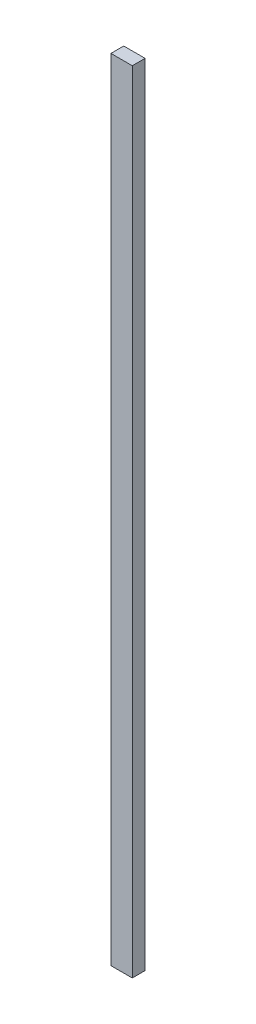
ISO-10303-21;
HEADER;
FILE_DESCRIPTION(('STEP AP214'),'2;1');
FILE_NAME('part.step','',(''),(''),'','','');
FILE_SCHEMA(('AUTOMOTIVE_DESIGN { 1 0 10303 214 1 1 1 1 }'));
ENDSEC;
DATA;
#1=APPLICATION_CONTEXT('core data for automotive mechanical design processes');
#2=APPLICATION_PROTOCOL_DEFINITION('international standard','automotive_design',2000,#1);
#3=PRODUCT_CONTEXT('',#1,'mechanical');
#4=PRODUCT('Part','Part','',(#3));
#5=PRODUCT_RELATED_PRODUCT_CATEGORY('part','',(#4));
#6=PRODUCT_DEFINITION_FORMATION('','',#4);
#7=PRODUCT_DEFINITION_CONTEXT('part definition',#1,'design');
#8=PRODUCT_DEFINITION('design','',#6,#7);
#9=PRODUCT_DEFINITION_SHAPE('','',#8);
#10=(LENGTH_UNIT() NAMED_UNIT(*) SI_UNIT(.MILLI.,.METRE.));
#11=(NAMED_UNIT(*) PLANE_ANGLE_UNIT() SI_UNIT($,.RADIAN.));
#12=(NAMED_UNIT(*) SI_UNIT($,.STERADIAN.) SOLID_ANGLE_UNIT());
#13=UNCERTAINTY_MEASURE_WITH_UNIT(LENGTH_MEASURE(1.E-05),#10,'distance_accuracy_value','');
#14=(GEOMETRIC_REPRESENTATION_CONTEXT(3) GLOBAL_UNCERTAINTY_ASSIGNED_CONTEXT((#13)) GLOBAL_UNIT_ASSIGNED_CONTEXT((#10,
#11,#12)) REPRESENTATION_CONTEXT('',''));
#15=CARTESIAN_POINT('',(0.,0.,0.));
#16=DIRECTION('',(0.,0.,1.));
#17=DIRECTION('',(1.,0.,0.));
#18=AXIS2_PLACEMENT_3D('',#15,#16,#17);
#19=CARTESIAN_POINT('',(0.,0.,12.));
#20=DIRECTION('',(0.,0.,1.));
#21=DIRECTION('',(1.,0.,0.));
#22=AXIS2_PLACEMENT_3D('',#19,#20,#21);
#23=PLANE('',#22);
#24=DIRECTION('',(1.,0.,0.));
#25=VECTOR('',#24,1.);
#26=CARTESIAN_POINT('',(-10.,-370.,12.));
#27=LINE('',#26,#25);
#28=CARTESIAN_POINT('',(-10.,-370.,12.));
#29=VERTEX_POINT('',#28);
#30=CARTESIAN_POINT('',(10.,-370.,12.));
#31=VERTEX_POINT('',#30);
#32=EDGE_CURVE('E91',#29,#31,#27,.T.);
#33=ORIENTED_EDGE('',*,*,#32,.T.);
#34=DIRECTION('',(0.,1.,0.));
#35=VECTOR('',#34,1.);
#36=CARTESIAN_POINT('',(10.,-370.,12.));
#37=LINE('',#36,#35);
#38=CARTESIAN_POINT('',(10.,370.,12.));
#39=VERTEX_POINT('',#38);
#40=EDGE_CURVE('E86',#31,#39,#37,.T.);
#41=ORIENTED_EDGE('',*,*,#40,.T.);
#42=DIRECTION('',(-1.,0.,0.));
#43=VECTOR('',#42,1.);
#44=CARTESIAN_POINT('',(10.,370.,12.));
#45=LINE('',#44,#43);
#46=CARTESIAN_POINT('',(-10.,370.,12.));
#47=VERTEX_POINT('',#46);
#48=EDGE_CURVE('E19',#39,#47,#45,.T.);
#49=ORIENTED_EDGE('',*,*,#48,.T.);
#50=DIRECTION('',(0.,-1.,0.));
#51=VECTOR('',#50,1.);
#52=CARTESIAN_POINT('',(-10.,370.,12.));
#53=LINE('',#52,#51);
#54=EDGE_CURVE('E10',#47,#29,#53,.T.);
#55=ORIENTED_EDGE('',*,*,#54,.T.);
#56=EDGE_LOOP('',(#33,#41,#49,#55));
#57=FACE_BOUND('',#56,.T.);
#58=ADVANCED_FACE('F16',(#57),#23,.T.);
#59=CARTESIAN_POINT('',(0.,0.,0.));
#60=DIRECTION('',(0.,0.,1.));
#61=DIRECTION('',(1.,0.,0.));
#62=AXIS2_PLACEMENT_3D('',#59,#60,#61);
#63=PLANE('',#62);
#64=DIRECTION('',(0.,-1.,0.));
#65=VECTOR('',#64,1.);
#66=CARTESIAN_POINT('',(-10.,370.,0.));
#67=LINE('',#66,#65);
#68=CARTESIAN_POINT('',(-10.,370.,0.));
#69=VERTEX_POINT('',#68);
#70=CARTESIAN_POINT('',(-10.,-370.,0.));
#71=VERTEX_POINT('',#70);
#72=EDGE_CURVE('E25',#69,#71,#67,.T.);
#73=ORIENTED_EDGE('',*,*,#72,.F.);
#74=DIRECTION('',(-1.,0.,0.));
#75=VECTOR('',#74,1.);
#76=CARTESIAN_POINT('',(10.,370.,0.));
#77=LINE('',#76,#75);
#78=CARTESIAN_POINT('',(10.,370.,0.));
#79=VERTEX_POINT('',#78);
#80=EDGE_CURVE('E74',#79,#69,#77,.T.);
#81=ORIENTED_EDGE('',*,*,#80,.F.);
#82=DIRECTION('',(0.,1.,0.));
#83=VECTOR('',#82,1.);
#84=CARTESIAN_POINT('',(10.,-370.,0.));
#85=LINE('',#84,#83);
#86=CARTESIAN_POINT('',(10.,-370.,0.));
#87=VERTEX_POINT('',#86);
#88=EDGE_CURVE('E68',#87,#79,#85,.T.);
#89=ORIENTED_EDGE('',*,*,#88,.F.);
#90=DIRECTION('',(1.,0.,0.));
#91=VECTOR('',#90,1.);
#92=CARTESIAN_POINT('',(-10.,-370.,0.));
#93=LINE('',#92,#91);
#94=EDGE_CURVE('E72',#71,#87,#93,.T.);
#95=ORIENTED_EDGE('',*,*,#94,.F.);
#96=EDGE_LOOP('',(#73,#81,#89,#95));
#97=FACE_BOUND('',#96,.T.);
#98=ADVANCED_FACE('F70',(#97),#63,.F.);
#99=CARTESIAN_POINT('',(-10.,370.,0.));
#100=DIRECTION('',(1.,0.,0.));
#101=DIRECTION('',(0.,1.,0.));
#102=AXIS2_PLACEMENT_3D('',#99,#100,#101);
#103=PLANE('',#102);
#104=ORIENTED_EDGE('',*,*,#72,.T.);
#105=DIRECTION('',(0.,0.,1.));
#106=VECTOR('',#105,1.);
#107=CARTESIAN_POINT('',(-10.,-370.,0.));
#108=LINE('',#107,#106);
#109=EDGE_CURVE('E80',#71,#29,#108,.T.);
#110=ORIENTED_EDGE('',*,*,#109,.T.);
#111=ORIENTED_EDGE('',*,*,#54,.F.);
#112=DIRECTION('',(0.,0.,1.));
#113=VECTOR('',#112,1.);
#114=CARTESIAN_POINT('',(-10.,370.,0.));
#115=LINE('',#114,#113);
#116=EDGE_CURVE('E110',#69,#47,#115,.T.);
#117=ORIENTED_EDGE('',*,*,#116,.F.);
#118=EDGE_LOOP('',(#104,#110,#111,#117));
#119=FACE_BOUND('',#118,.T.);
#120=ADVANCED_FACE('F121',(#119),#103,.F.);
#121=CARTESIAN_POINT('',(10.,370.,0.));
#122=DIRECTION('',(0.,-1.,0.));
#123=DIRECTION('',(0.,0.,-1.));
#124=AXIS2_PLACEMENT_3D('',#121,#122,#123);
#125=PLANE('',#124);
#126=ORIENTED_EDGE('',*,*,#80,.T.);
#127=ORIENTED_EDGE('',*,*,#116,.T.);
#128=ORIENTED_EDGE('',*,*,#48,.F.);
#129=DIRECTION('',(0.,0.,1.));
#130=VECTOR('',#129,1.);
#131=CARTESIAN_POINT('',(10.,370.,0.));
#132=LINE('',#131,#130);
#133=EDGE_CURVE('E79',#79,#39,#132,.T.);
#134=ORIENTED_EDGE('',*,*,#133,.F.);
#135=EDGE_LOOP('',(#126,#127,#128,#134));
#136=FACE_BOUND('',#135,.T.);
#137=ADVANCED_FACE('F119',(#136),#125,.F.);
#138=CARTESIAN_POINT('',(10.,-370.,0.));
#139=DIRECTION('',(-1.,0.,0.));
#140=DIRECTION('',(0.,0.,1.));
#141=AXIS2_PLACEMENT_3D('',#138,#139,#140);
#142=PLANE('',#141);
#143=ORIENTED_EDGE('',*,*,#88,.T.);
#144=ORIENTED_EDGE('',*,*,#133,.T.);
#145=ORIENTED_EDGE('',*,*,#40,.F.);
#146=DIRECTION('',(0.,0.,1.));
#147=VECTOR('',#146,1.);
#148=CARTESIAN_POINT('',(10.,-370.,0.));
#149=LINE('',#148,#147);
#150=EDGE_CURVE('E83',#87,#31,#149,.T.);
#151=ORIENTED_EDGE('',*,*,#150,.F.);
#152=EDGE_LOOP('',(#143,#144,#145,#151));
#153=FACE_BOUND('',#152,.T.);
#154=ADVANCED_FACE('F84',(#153),#142,.F.);
#155=CARTESIAN_POINT('',(-10.,-370.,0.));
#156=DIRECTION('',(0.,1.,0.));
#157=DIRECTION('',(1.,0.,0.));
#158=AXIS2_PLACEMENT_3D('',#155,#156,#157);
#159=PLANE('',#158);
#160=ORIENTED_EDGE('',*,*,#94,.T.);
#161=ORIENTED_EDGE('',*,*,#150,.T.);
#162=ORIENTED_EDGE('',*,*,#32,.F.);
#163=ORIENTED_EDGE('',*,*,#109,.F.);
#164=EDGE_LOOP('',(#160,#161,#162,#163));
#165=FACE_BOUND('',#164,.T.);
#166=ADVANCED_FACE('F94',(#165),#159,.F.);
#167=CLOSED_SHELL('',(#58,#98,#120,#137,#154,#166));
#168=MANIFOLD_SOLID_BREP('B1',#167);
#169=ADVANCED_BREP_SHAPE_REPRESENTATION('',(#18,#168),#14);
#170=SHAPE_DEFINITION_REPRESENTATION(#9,#169);
ENDSEC;
END-ISO-10303-21;
